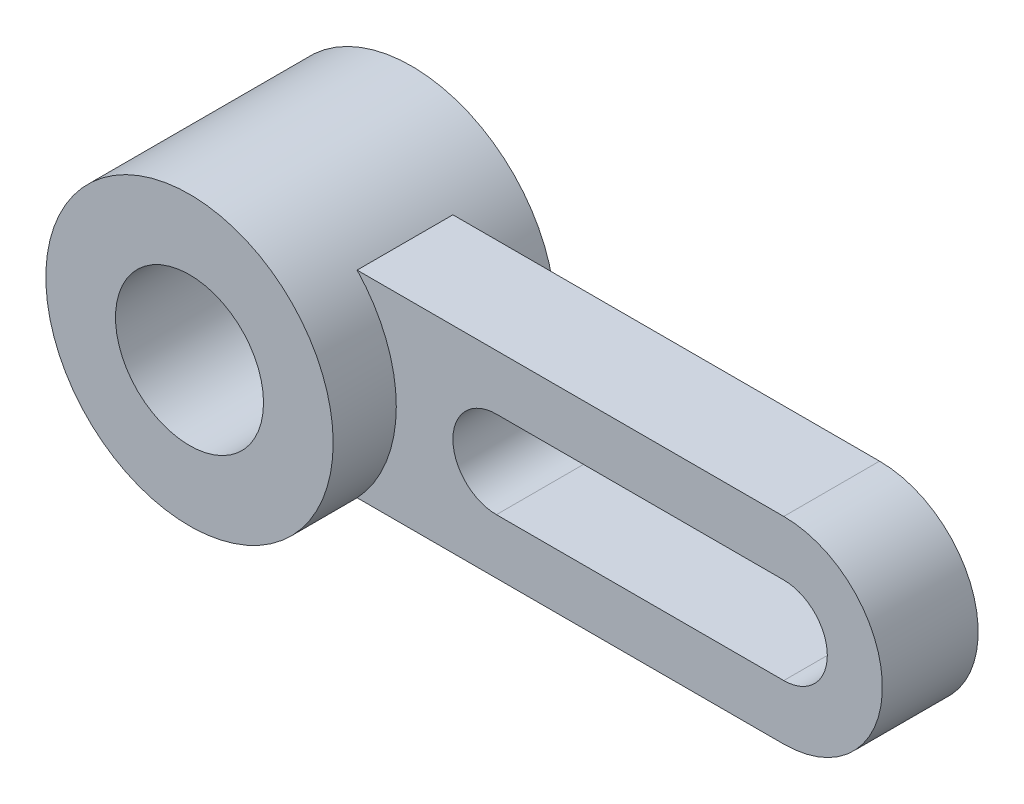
ISO-10303-21;
HEADER;
FILE_DESCRIPTION(('STEP AP214'),'2;1');
FILE_NAME('part.step','',(''),(''),'','','');
FILE_SCHEMA(('AUTOMOTIVE_DESIGN { 1 0 10303 214 1 1 1 1 }'));
ENDSEC;
DATA;
#1=APPLICATION_CONTEXT('core data for automotive mechanical design processes');
#2=APPLICATION_PROTOCOL_DEFINITION('international standard','automotive_design',2000,#1);
#3=PRODUCT_CONTEXT('',#1,'mechanical');
#4=PRODUCT('Part','Part','',(#3));
#5=PRODUCT_RELATED_PRODUCT_CATEGORY('part','',(#4));
#6=PRODUCT_DEFINITION_FORMATION('','',#4);
#7=PRODUCT_DEFINITION_CONTEXT('part definition',#1,'design');
#8=PRODUCT_DEFINITION('design','',#6,#7);
#9=PRODUCT_DEFINITION_SHAPE('','',#8);
#10=(LENGTH_UNIT() NAMED_UNIT(*) SI_UNIT(.MILLI.,.METRE.));
#11=(NAMED_UNIT(*) PLANE_ANGLE_UNIT() SI_UNIT($,.RADIAN.));
#12=(NAMED_UNIT(*) SI_UNIT($,.STERADIAN.) SOLID_ANGLE_UNIT());
#13=UNCERTAINTY_MEASURE_WITH_UNIT(LENGTH_MEASURE(1.E-05),#10,'distance_accuracy_value','');
#14=(GEOMETRIC_REPRESENTATION_CONTEXT(3) GLOBAL_UNCERTAINTY_ASSIGNED_CONTEXT((#13)) GLOBAL_UNIT_ASSIGNED_CONTEXT((#10,
#11,#12)) REPRESENTATION_CONTEXT('',''));
#15=CARTESIAN_POINT('',(0.,0.,0.));
#16=DIRECTION('',(0.,0.,1.));
#17=DIRECTION('',(1.,0.,0.));
#18=AXIS2_PLACEMENT_3D('',#15,#16,#17);
#19=CARTESIAN_POINT('',(0.,0.,-51.));
#20=DIRECTION('',(0.,0.,1.));
#21=DIRECTION('',(1.,0.,0.));
#22=AXIS2_PLACEMENT_3D('',#19,#20,#21);
#23=CYLINDRICAL_SURFACE('',#22,66.);
#24=CARTESIAN_POINT('',(0.,0.,-22.));
#25=DIRECTION('',(0.,0.,-1.));
#26=DIRECTION('',(-1.,0.,0.));
#27=AXIS2_PLACEMENT_3D('',#24,#25,#26);
#28=CIRCLE('',#27,66.);
#29=CARTESIAN_POINT('',(48.,-45.2990066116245,-22.));
#30=VERTEX_POINT('',#29);
#31=CARTESIAN_POINT('',(48.,45.2990066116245,-22.));
#32=VERTEX_POINT('',#31);
#33=EDGE_CURVE('E11',#30,#32,#28,.F.);
#34=ORIENTED_EDGE('',*,*,#33,.F.);
#35=DIRECTION('',(0.,0.,1.));
#36=VECTOR('',#35,1.);
#37=CARTESIAN_POINT('',(48.,-45.2990066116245,-22.));
#38=LINE('',#37,#36);
#39=CARTESIAN_POINT('',(48.,-45.2990066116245,22.));
#40=VERTEX_POINT('',#39);
#41=EDGE_CURVE('E150',#30,#40,#38,.T.);
#42=ORIENTED_EDGE('',*,*,#41,.T.);
#43=CARTESIAN_POINT('',(0.,0.,22.));
#44=DIRECTION('',(0.,0.,-1.));
#45=DIRECTION('',(-1.,0.,0.));
#46=AXIS2_PLACEMENT_3D('',#43,#44,#45);
#47=CIRCLE('',#46,66.);
#48=CARTESIAN_POINT('',(48.,45.2990066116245,22.));
#49=VERTEX_POINT('',#48);
#50=EDGE_CURVE('E38',#40,#49,#47,.F.);
#51=ORIENTED_EDGE('',*,*,#50,.T.);
#52=DIRECTION('',(0.,0.,1.));
#53=VECTOR('',#52,1.);
#54=CARTESIAN_POINT('',(48.,45.2990066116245,-22.));
#55=LINE('',#54,#53);
#56=EDGE_CURVE('E151',#32,#49,#55,.T.);
#57=ORIENTED_EDGE('',*,*,#56,.F.);
#58=EDGE_LOOP('',(#34,#42,#51,#57));
#59=FACE_BOUND('',#58,.T.);
#60=CARTESIAN_POINT('',(0.,0.,-51.));
#61=DIRECTION('',(0.,0.,1.));
#62=DIRECTION('',(1.,0.,0.));
#63=AXIS2_PLACEMENT_3D('',#60,#61,#62);
#64=CIRCLE('',#63,66.);
#65=CARTESIAN_POINT('',(66.,0.,-51.));
#66=VERTEX_POINT('',#65);
#67=EDGE_CURVE('E168',#66,#66,#64,.T.);
#68=ORIENTED_EDGE('',*,*,#67,.T.);
#69=EDGE_LOOP('',(#68));
#70=FACE_BOUND('',#69,.T.);
#71=CARTESIAN_POINT('',(0.,0.,51.));
#72=DIRECTION('',(0.,0.,1.));
#73=DIRECTION('',(1.,0.,0.));
#74=AXIS2_PLACEMENT_3D('',#71,#72,#73);
#75=CIRCLE('',#74,66.);
#76=CARTESIAN_POINT('',(66.,0.,51.));
#77=VERTEX_POINT('',#76);
#78=EDGE_CURVE('E162',#77,#77,#75,.T.);
#79=ORIENTED_EDGE('',*,*,#78,.F.);
#80=EDGE_LOOP('',(#79));
#81=FACE_BOUND('',#80,.T.);
#82=ADVANCED_FACE('F31',(#59,#70,#81),#23,.T.);
#83=CARTESIAN_POINT('',(0.,0.,-51.));
#84=DIRECTION('',(0.,0.,1.));
#85=DIRECTION('',(1.,0.,0.));
#86=AXIS2_PLACEMENT_3D('',#83,#84,#85);
#87=PLANE('',#86);
#88=CARTESIAN_POINT('',(0.,0.,-51.));
#89=DIRECTION('',(0.,0.,1.));
#90=DIRECTION('',(1.,0.,0.));
#91=AXIS2_PLACEMENT_3D('',#88,#89,#90);
#92=CIRCLE('',#91,34.);
#93=CARTESIAN_POINT('',(34.,0.,-51.));
#94=VERTEX_POINT('',#93);
#95=EDGE_CURVE('E165',#94,#94,#92,.T.);
#96=ORIENTED_EDGE('',*,*,#95,.T.);
#97=EDGE_LOOP('',(#96));
#98=FACE_BOUND('',#97,.T.);
#99=ORIENTED_EDGE('',*,*,#67,.F.);
#100=EDGE_LOOP('',(#99));
#101=FACE_BOUND('',#100,.T.);
#102=ADVANCED_FACE('F201',(#98,#101),#87,.F.);
#103=CARTESIAN_POINT('',(0.,0.,-51.));
#104=DIRECTION('',(0.,0.,1.));
#105=DIRECTION('',(1.,0.,0.));
#106=AXIS2_PLACEMENT_3D('',#103,#104,#105);
#107=CYLINDRICAL_SURFACE('',#106,34.);
#108=ORIENTED_EDGE('',*,*,#95,.F.);
#109=EDGE_LOOP('',(#108));
#110=FACE_BOUND('',#109,.T.);
#111=CARTESIAN_POINT('',(0.,0.,51.));
#112=DIRECTION('',(0.,0.,1.));
#113=DIRECTION('',(1.,0.,0.));
#114=AXIS2_PLACEMENT_3D('',#111,#112,#113);
#115=CIRCLE('',#114,34.);
#116=CARTESIAN_POINT('',(34.,0.,51.));
#117=VERTEX_POINT('',#116);
#118=EDGE_CURVE('E153',#117,#117,#115,.T.);
#119=ORIENTED_EDGE('',*,*,#118,.T.);
#120=EDGE_LOOP('',(#119));
#121=FACE_BOUND('',#120,.T.);
#122=ADVANCED_FACE('F196',(#110,#121),#107,.F.);
#123=CARTESIAN_POINT('',(0.,0.,51.));
#124=DIRECTION('',(0.,0.,1.));
#125=DIRECTION('',(1.,0.,0.));
#126=AXIS2_PLACEMENT_3D('',#123,#124,#125);
#127=PLANE('',#126);
#128=ORIENTED_EDGE('',*,*,#78,.T.);
#129=EDGE_LOOP('',(#128));
#130=FACE_BOUND('',#129,.T.);
#131=ORIENTED_EDGE('',*,*,#118,.F.);
#132=EDGE_LOOP('',(#131));
#133=FACE_BOUND('',#132,.T.);
#134=ADVANCED_FACE('F189',(#130,#133),#127,.T.);
#135=CARTESIAN_POINT('',(48.,45.2990066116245,-22.));
#136=DIRECTION('',(0.,1.,0.));
#137=DIRECTION('',(0.,0.,1.));
#138=AXIS2_PLACEMENT_3D('',#135,#136,#137);
#139=PLANE('',#138);
#140=ORIENTED_EDGE('',*,*,#56,.T.);
#141=DIRECTION('',(-1.,0.,0.));
#142=VECTOR('',#141,1.);
#143=CARTESIAN_POINT('',(48.,45.2990066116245,22.));
#144=LINE('',#143,#142);
#145=CARTESIAN_POINT('',(244.,45.2990066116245,22.));
#146=VERTEX_POINT('',#145);
#147=EDGE_CURVE('E45',#146,#49,#144,.T.);
#148=ORIENTED_EDGE('',*,*,#147,.F.);
#149=DIRECTION('',(0.,0.,1.));
#150=VECTOR('',#149,1.);
#151=CARTESIAN_POINT('',(244.,45.2990066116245,-22.));
#152=LINE('',#151,#150);
#153=CARTESIAN_POINT('',(244.,45.2990066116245,-22.));
#154=VERTEX_POINT('',#153);
#155=EDGE_CURVE('E154',#154,#146,#152,.T.);
#156=ORIENTED_EDGE('',*,*,#155,.F.);
#157=DIRECTION('',(-1.,0.,0.));
#158=VECTOR('',#157,1.);
#159=CARTESIAN_POINT('',(48.,45.2990066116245,-22.));
#160=LINE('',#159,#158);
#161=EDGE_CURVE('E147',#154,#32,#160,.T.);
#162=ORIENTED_EDGE('',*,*,#161,.T.);
#163=EDGE_LOOP('',(#140,#148,#156,#162));
#164=FACE_BOUND('',#163,.T.);
#165=ADVANCED_FACE('F187',(#164),#139,.T.);
#166=CARTESIAN_POINT('',(244.,0.,-22.));
#167=DIRECTION('',(0.,0.,1.));
#168=DIRECTION('',(1.,0.,0.));
#169=AXIS2_PLACEMENT_3D('',#166,#167,#168);
#170=CYLINDRICAL_SURFACE('',#169,45.2990066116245);
#171=ORIENTED_EDGE('',*,*,#155,.T.);
#172=CARTESIAN_POINT('',(244.,0.,22.));
#173=DIRECTION('',(0.,0.,1.));
#174=DIRECTION('',(-1.,0.,0.));
#175=AXIS2_PLACEMENT_3D('',#172,#173,#174);
#176=CIRCLE('',#175,45.2990066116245);
#177=CARTESIAN_POINT('',(244.,-45.2990066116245,22.));
#178=VERTEX_POINT('',#177);
#179=EDGE_CURVE('E128',#178,#146,#176,.T.);
#180=ORIENTED_EDGE('',*,*,#179,.F.);
#181=DIRECTION('',(0.,0.,1.));
#182=VECTOR('',#181,1.);
#183=CARTESIAN_POINT('',(244.,-45.2990066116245,-22.));
#184=LINE('',#183,#182);
#185=CARTESIAN_POINT('',(244.,-45.2990066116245,-22.));
#186=VERTEX_POINT('',#185);
#187=EDGE_CURVE('E156',#186,#178,#184,.T.);
#188=ORIENTED_EDGE('',*,*,#187,.F.);
#189=CARTESIAN_POINT('',(244.,0.,-22.));
#190=DIRECTION('',(0.,0.,1.));
#191=DIRECTION('',(-1.,0.,0.));
#192=AXIS2_PLACEMENT_3D('',#189,#190,#191);
#193=CIRCLE('',#192,45.2990066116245);
#194=EDGE_CURVE('E144',#186,#154,#193,.T.);
#195=ORIENTED_EDGE('',*,*,#194,.T.);
#196=EDGE_LOOP('',(#171,#180,#188,#195));
#197=FACE_BOUND('',#196,.T.);
#198=ADVANCED_FACE('F182',(#197),#170,.T.);
#199=CARTESIAN_POINT('',(244.,-45.2990066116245,-22.));
#200=DIRECTION('',(0.,-1.,0.));
#201=DIRECTION('',(0.,0.,-1.));
#202=AXIS2_PLACEMENT_3D('',#199,#200,#201);
#203=PLANE('',#202);
#204=ORIENTED_EDGE('',*,*,#187,.T.);
#205=DIRECTION('',(1.,0.,0.));
#206=VECTOR('',#205,1.);
#207=CARTESIAN_POINT('',(244.,-45.2990066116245,22.));
#208=LINE('',#207,#206);
#209=EDGE_CURVE('E125',#40,#178,#208,.T.);
#210=ORIENTED_EDGE('',*,*,#209,.F.);
#211=ORIENTED_EDGE('',*,*,#41,.F.);
#212=DIRECTION('',(1.,0.,0.));
#213=VECTOR('',#212,1.);
#214=CARTESIAN_POINT('',(244.,-45.2990066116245,-22.));
#215=LINE('',#214,#213);
#216=EDGE_CURVE('E138',#30,#186,#215,.T.);
#217=ORIENTED_EDGE('',*,*,#216,.T.);
#218=EDGE_LOOP('',(#204,#210,#211,#217));
#219=FACE_BOUND('',#218,.T.);
#220=ADVANCED_FACE('F178',(#219),#203,.T.);
#221=CARTESIAN_POINT('',(244.,0.,-22.));
#222=DIRECTION('',(0.,0.,-1.));
#223=DIRECTION('',(-1.,0.,0.));
#224=AXIS2_PLACEMENT_3D('',#221,#222,#223);
#225=PLANE('',#224);
#226=CARTESIAN_POINT('',(112.,0.,-22.));
#227=DIRECTION('',(0.,0.,1.));
#228=DIRECTION('',(1.,0.,0.));
#229=AXIS2_PLACEMENT_3D('',#226,#227,#228);
#230=CIRCLE('',#229,20.);
#231=CARTESIAN_POINT('',(112.,20.,-22.));
#232=VERTEX_POINT('',#231);
#233=CARTESIAN_POINT('',(112.,-20.,-22.));
#234=VERTEX_POINT('',#233);
#235=EDGE_CURVE('E131',#232,#234,#230,.T.);
#236=ORIENTED_EDGE('',*,*,#235,.T.);
#237=DIRECTION('',(1.,0.,0.));
#238=VECTOR('',#237,1.);
#239=CARTESIAN_POINT('',(244.,-20.,-22.));
#240=LINE('',#239,#238);
#241=CARTESIAN_POINT('',(244.,-20.,-22.));
#242=VERTEX_POINT('',#241);
#243=EDGE_CURVE('E102',#234,#242,#240,.T.);
#244=ORIENTED_EDGE('',*,*,#243,.T.);
#245=CARTESIAN_POINT('',(244.,0.,-22.));
#246=DIRECTION('',(0.,0.,1.));
#247=DIRECTION('',(-1.,0.,0.));
#248=AXIS2_PLACEMENT_3D('',#245,#246,#247);
#249=CIRCLE('',#248,20.);
#250=CARTESIAN_POINT('',(244.,20.,-22.));
#251=VERTEX_POINT('',#250);
#252=EDGE_CURVE('E53',#242,#251,#249,.T.);
#253=ORIENTED_EDGE('',*,*,#252,.T.);
#254=DIRECTION('',(-1.,0.,0.));
#255=VECTOR('',#254,1.);
#256=CARTESIAN_POINT('',(112.,20.,-22.));
#257=LINE('',#256,#255);
#258=EDGE_CURVE('E107',#251,#232,#257,.T.);
#259=ORIENTED_EDGE('',*,*,#258,.T.);
#260=EDGE_LOOP('',(#236,#244,#253,#259));
#261=FACE_BOUND('',#260,.T.);
#262=ORIENTED_EDGE('',*,*,#216,.F.);
#263=ORIENTED_EDGE('',*,*,#33,.T.);
#264=ORIENTED_EDGE('',*,*,#161,.F.);
#265=ORIENTED_EDGE('',*,*,#194,.F.);
#266=EDGE_LOOP('',(#262,#263,#264,#265));
#267=FACE_BOUND('',#266,.T.);
#268=ADVANCED_FACE('F185',(#261,#267),#225,.T.);
#269=CARTESIAN_POINT('',(112.,0.,-22.));
#270=DIRECTION('',(0.,0.,1.));
#271=DIRECTION('',(1.,0.,0.));
#272=AXIS2_PLACEMENT_3D('',#269,#270,#271);
#273=CYLINDRICAL_SURFACE('',#272,20.);
#274=DIRECTION('',(0.,0.,1.));
#275=VECTOR('',#274,1.);
#276=CARTESIAN_POINT('',(112.,20.,-22.));
#277=LINE('',#276,#275);
#278=CARTESIAN_POINT('',(112.,20.,22.));
#279=VERTEX_POINT('',#278);
#280=EDGE_CURVE('E112',#232,#279,#277,.T.);
#281=ORIENTED_EDGE('',*,*,#280,.T.);
#282=CARTESIAN_POINT('',(112.,0.,22.));
#283=DIRECTION('',(0.,0.,1.));
#284=DIRECTION('',(1.,0.,0.));
#285=AXIS2_PLACEMENT_3D('',#282,#283,#284);
#286=CIRCLE('',#285,20.);
#287=CARTESIAN_POINT('',(112.,-20.,22.));
#288=VERTEX_POINT('',#287);
#289=EDGE_CURVE('E110',#279,#288,#286,.T.);
#290=ORIENTED_EDGE('',*,*,#289,.T.);
#291=DIRECTION('',(0.,0.,1.));
#292=VECTOR('',#291,1.);
#293=CARTESIAN_POINT('',(112.,-20.,-22.));
#294=LINE('',#293,#292);
#295=EDGE_CURVE('E95',#234,#288,#294,.T.);
#296=ORIENTED_EDGE('',*,*,#295,.F.);
#297=ORIENTED_EDGE('',*,*,#235,.F.);
#298=EDGE_LOOP('',(#281,#290,#296,#297));
#299=FACE_BOUND('',#298,.T.);
#300=ADVANCED_FACE('F111',(#299),#273,.F.);
#301=CARTESIAN_POINT('',(112.,20.,-22.));
#302=DIRECTION('',(0.,1.,0.));
#303=DIRECTION('',(-1.,0.,0.));
#304=AXIS2_PLACEMENT_3D('',#301,#302,#303);
#305=PLANE('',#304);
#306=DIRECTION('',(0.,0.,1.));
#307=VECTOR('',#306,1.);
#308=CARTESIAN_POINT('',(244.,20.,-22.));
#309=LINE('',#308,#307);
#310=CARTESIAN_POINT('',(244.,20.,22.));
#311=VERTEX_POINT('',#310);
#312=EDGE_CURVE('E139',#251,#311,#309,.T.);
#313=ORIENTED_EDGE('',*,*,#312,.T.);
#314=DIRECTION('',(-1.,0.,0.));
#315=VECTOR('',#314,1.);
#316=CARTESIAN_POINT('',(112.,20.,22.));
#317=LINE('',#316,#315);
#318=EDGE_CURVE('E121',#311,#279,#317,.T.);
#319=ORIENTED_EDGE('',*,*,#318,.T.);
#320=ORIENTED_EDGE('',*,*,#280,.F.);
#321=ORIENTED_EDGE('',*,*,#258,.F.);
#322=EDGE_LOOP('',(#313,#319,#320,#321));
#323=FACE_BOUND('',#322,.T.);
#324=ADVANCED_FACE('F221',(#323),#305,.F.);
#325=CARTESIAN_POINT('',(244.,0.,-22.));
#326=DIRECTION('',(0.,0.,1.));
#327=DIRECTION('',(1.,0.,0.));
#328=AXIS2_PLACEMENT_3D('',#325,#326,#327);
#329=CYLINDRICAL_SURFACE('',#328,20.);
#330=DIRECTION('',(0.,0.,1.));
#331=VECTOR('',#330,1.);
#332=CARTESIAN_POINT('',(244.,-20.,-22.));
#333=LINE('',#332,#331);
#334=CARTESIAN_POINT('',(244.,-20.,22.));
#335=VERTEX_POINT('',#334);
#336=EDGE_CURVE('E106',#242,#335,#333,.T.);
#337=ORIENTED_EDGE('',*,*,#336,.T.);
#338=CARTESIAN_POINT('',(244.,0.,22.));
#339=DIRECTION('',(0.,0.,1.));
#340=DIRECTION('',(-1.,0.,0.));
#341=AXIS2_PLACEMENT_3D('',#338,#339,#340);
#342=CIRCLE('',#341,20.);
#343=EDGE_CURVE('E119',#335,#311,#342,.T.);
#344=ORIENTED_EDGE('',*,*,#343,.T.);
#345=ORIENTED_EDGE('',*,*,#312,.F.);
#346=ORIENTED_EDGE('',*,*,#252,.F.);
#347=EDGE_LOOP('',(#337,#344,#345,#346));
#348=FACE_BOUND('',#347,.T.);
#349=ADVANCED_FACE('F226',(#348),#329,.F.);
#350=CARTESIAN_POINT('',(244.,-20.,-22.));
#351=DIRECTION('',(0.,-1.,0.));
#352=DIRECTION('',(1.,0.,0.));
#353=AXIS2_PLACEMENT_3D('',#350,#351,#352);
#354=PLANE('',#353);
#355=ORIENTED_EDGE('',*,*,#295,.T.);
#356=DIRECTION('',(1.,0.,0.));
#357=VECTOR('',#356,1.);
#358=CARTESIAN_POINT('',(244.,-20.,22.));
#359=LINE('',#358,#357);
#360=EDGE_CURVE('E99',#288,#335,#359,.T.);
#361=ORIENTED_EDGE('',*,*,#360,.T.);
#362=ORIENTED_EDGE('',*,*,#336,.F.);
#363=ORIENTED_EDGE('',*,*,#243,.F.);
#364=EDGE_LOOP('',(#355,#361,#362,#363));
#365=FACE_BOUND('',#364,.T.);
#366=ADVANCED_FACE('F97',(#365),#354,.F.);
#367=CARTESIAN_POINT('',(244.,0.,22.));
#368=DIRECTION('',(0.,0.,-1.));
#369=DIRECTION('',(-1.,0.,0.));
#370=AXIS2_PLACEMENT_3D('',#367,#368,#369);
#371=PLANE('',#370);
#372=ORIENTED_EDGE('',*,*,#50,.F.);
#373=ORIENTED_EDGE('',*,*,#209,.T.);
#374=ORIENTED_EDGE('',*,*,#179,.T.);
#375=ORIENTED_EDGE('',*,*,#147,.T.);
#376=EDGE_LOOP('',(#372,#373,#374,#375));
#377=FACE_BOUND('',#376,.T.);
#378=ORIENTED_EDGE('',*,*,#289,.F.);
#379=ORIENTED_EDGE('',*,*,#318,.F.);
#380=ORIENTED_EDGE('',*,*,#343,.F.);
#381=ORIENTED_EDGE('',*,*,#360,.F.);
#382=EDGE_LOOP('',(#378,#379,#380,#381));
#383=FACE_BOUND('',#382,.T.);
#384=ADVANCED_FACE('F117',(#377,#383),#371,.F.);
#385=CLOSED_SHELL('',(#82,#102,#122,#134,#165,#198,#220,#268,#300,#324,#349,#366,#384));
#386=MANIFOLD_SOLID_BREP('B2',#385);
#387=ADVANCED_BREP_SHAPE_REPRESENTATION('',(#18,#386),#14);
#388=SHAPE_DEFINITION_REPRESENTATION(#9,#387);
ENDSEC;
END-ISO-10303-21;
